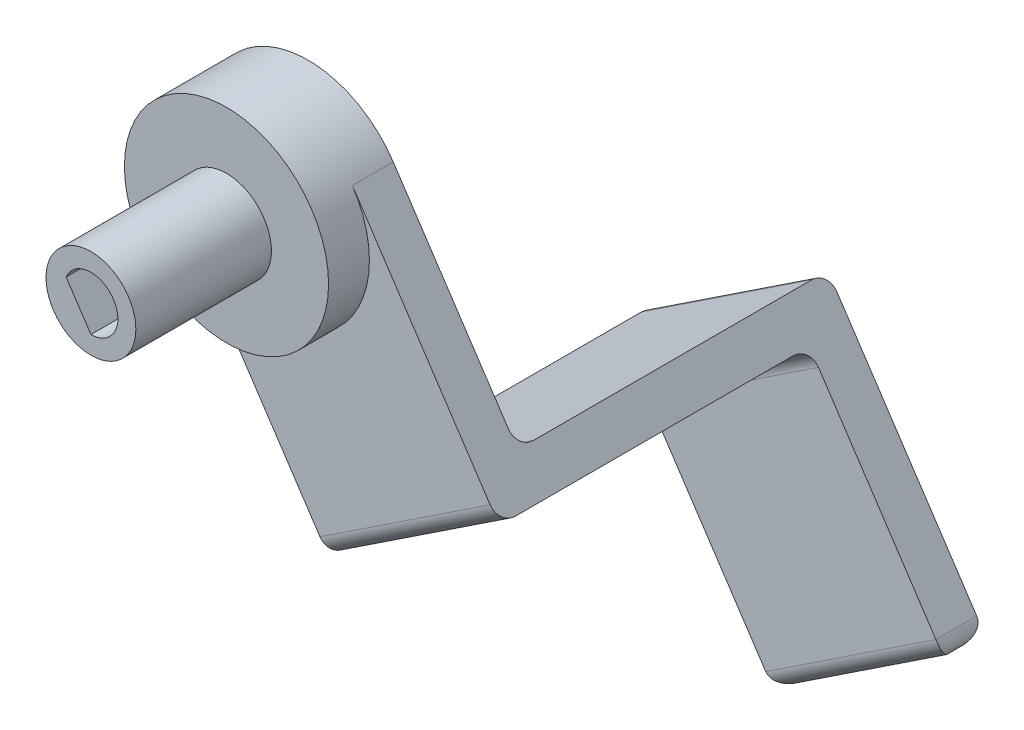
ISO-10303-21;
HEADER;
FILE_DESCRIPTION(('STEP AP214'),'2;1');
FILE_NAME('part.step','',(''),(''),'','','');
FILE_SCHEMA(('AUTOMOTIVE_DESIGN { 1 0 10303 214 1 1 1 1 }'));
ENDSEC;
DATA;
#1=APPLICATION_CONTEXT('core data for automotive mechanical design processes');
#2=APPLICATION_PROTOCOL_DEFINITION('international standard','automotive_design',2000,#1);
#3=PRODUCT_CONTEXT('',#1,'mechanical');
#4=PRODUCT('Part','Part','',(#3));
#5=PRODUCT_RELATED_PRODUCT_CATEGORY('part','',(#4));
#6=PRODUCT_DEFINITION_FORMATION('','',#4);
#7=PRODUCT_DEFINITION_CONTEXT('part definition',#1,'design');
#8=PRODUCT_DEFINITION('design','',#6,#7);
#9=PRODUCT_DEFINITION_SHAPE('','',#8);
#10=(LENGTH_UNIT() NAMED_UNIT(*) SI_UNIT(.MILLI.,.METRE.));
#11=(NAMED_UNIT(*) PLANE_ANGLE_UNIT() SI_UNIT($,.RADIAN.));
#12=(NAMED_UNIT(*) SI_UNIT($,.STERADIAN.) SOLID_ANGLE_UNIT());
#13=UNCERTAINTY_MEASURE_WITH_UNIT(LENGTH_MEASURE(1.E-05),#10,'distance_accuracy_value','');
#14=(GEOMETRIC_REPRESENTATION_CONTEXT(3) GLOBAL_UNCERTAINTY_ASSIGNED_CONTEXT((#13)) GLOBAL_UNIT_ASSIGNED_CONTEXT((#10,
#11,#12)) REPRESENTATION_CONTEXT('',''));
#15=CARTESIAN_POINT('',(0.,0.,0.));
#16=DIRECTION('',(0.,0.,1.));
#17=DIRECTION('',(1.,0.,0.));
#18=AXIS2_PLACEMENT_3D('',#15,#16,#17);
#19=CARTESIAN_POINT('',(16.4449312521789,-24.7916666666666,0.));
#20=DIRECTION('',(-0.552770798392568,0.833333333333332,0.));
#21=DIRECTION('',(-0.833333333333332,-0.552770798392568,0.));
#22=AXIS2_PLACEMENT_3D('',#19,#20,#21);
#23=PLANE('',#22);
#24=DIRECTION('',(0.,0.,1.));
#25=VECTOR('',#24,1.);
#26=CARTESIAN_POINT('',(28.3817176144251,-16.8736983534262,-20.));
#27=LINE('',#26,#25);
#28=CARTESIAN_POINT('',(28.3817176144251,-16.8736983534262,-51.));
#29=VERTEX_POINT('',#28);
#30=CARTESIAN_POINT('',(28.3817176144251,-16.8736983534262,-17.));
#31=VERTEX_POINT('',#30);
#32=EDGE_CURVE('E176',#29,#31,#27,.T.);
#33=ORIENTED_EDGE('',*,*,#32,.T.);
#34=DIRECTION('',(-0.833333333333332,-0.552770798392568,0.));
#35=VECTOR('',#34,1.);
#36=CARTESIAN_POINT('',(7.5483842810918,-30.6929683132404,-17.));
#37=LINE('',#36,#35);
#38=CARTESIAN_POINT('',(7.5483842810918,-30.6929683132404,-17.));
#39=VERTEX_POINT('',#38);
#40=EDGE_CURVE('E288',#31,#39,#37,.T.);
#41=ORIENTED_EDGE('',*,*,#40,.T.);
#42=DIRECTION('',(0.,0.,1.));
#43=VECTOR('',#42,1.);
#44=CARTESIAN_POINT('',(7.54838428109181,-30.6929683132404,-20.));
#45=LINE('',#44,#43);
#46=CARTESIAN_POINT('',(7.54838428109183,-30.6929683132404,-51.));
#47=VERTEX_POINT('',#46);
#48=EDGE_CURVE('E348',#47,#39,#45,.T.);
#49=ORIENTED_EDGE('',*,*,#48,.F.);
#50=DIRECTION('',(-0.833333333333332,-0.552770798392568,0.));
#51=VECTOR('',#50,1.);
#52=CARTESIAN_POINT('',(28.3817176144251,-16.8736983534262,-51.));
#53=LINE('',#52,#51);
#54=EDGE_CURVE('E285',#47,#29,#53,.F.);
#55=ORIENTED_EDGE('',*,*,#54,.T.);
#56=EDGE_LOOP('',(#33,#41,#49,#55));
#57=FACE_BOUND('',#56,.T.);
#58=ADVANCED_FACE('F47',(#57),#23,.F.);
#59=CARTESIAN_POINT('',(0.,3.3,6.6));
#60=DIRECTION('',(0.,0.,1.));
#61=DIRECTION('',(1.,0.,0.));
#62=AXIS2_PLACEMENT_3D('',#59,#60,#61);
#63=PLANE('',#62);
#64=CARTESIAN_POINT('',(0.,3.3,6.6));
#65=DIRECTION('',(0.,0.,1.));
#66=DIRECTION('',(1.,0.,0.));
#67=AXIS2_PLACEMENT_3D('',#64,#65,#66);
#68=CIRCLE('',#67,5.5);
#69=CARTESIAN_POINT('',(5.5,3.3,6.6));
#70=VERTEX_POINT('',#69);
#71=EDGE_CURVE('E224',#70,#70,#68,.T.);
#72=ORIENTED_EDGE('',*,*,#71,.T.);
#73=EDGE_LOOP('',(#72));
#74=FACE_BOUND('',#73,.T.);
#75=DIRECTION('',(0.552770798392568,-0.833333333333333,0.));
#76=VECTOR('',#75,1.);
#77=CARTESIAN_POINT('',(0.,0.,6.6));
#78=LINE('',#77,#76);
#79=CARTESIAN_POINT('',(-3.04023939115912,4.58333333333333,6.6));
#80=VERTEX_POINT('',#79);
#81=CARTESIAN_POINT('',(0.,0.,6.6));
#82=VERTEX_POINT('',#81);
#83=EDGE_CURVE('E207',#80,#82,#78,.T.);
#84=ORIENTED_EDGE('',*,*,#83,.F.);
#85=CARTESIAN_POINT('',(0.,3.3,6.6));
#86=DIRECTION('',(0.,0.,1.));
#87=DIRECTION('',(1.,0.,0.));
#88=AXIS2_PLACEMENT_3D('',#85,#86,#87);
#89=CIRCLE('',#88,3.3);
#90=EDGE_CURVE('E203',#82,#80,#89,.T.);
#91=ORIENTED_EDGE('',*,*,#90,.F.);
#92=EDGE_LOOP('',(#84,#91));
#93=FACE_BOUND('',#92,.T.);
#94=ADVANCED_FACE('F420',(#74,#93),#63,.T.);
#95=CARTESIAN_POINT('',(0.,3.3,6.6));
#96=DIRECTION('',(0.,0.,-1.));
#97=DIRECTION('',(-1.,0.,0.));
#98=AXIS2_PLACEMENT_3D('',#95,#96,#97);
#99=CYLINDRICAL_SURFACE('',#98,5.5);
#100=ORIENTED_EDGE('',*,*,#71,.F.);
#101=EDGE_LOOP('',(#100));
#102=FACE_BOUND('',#101,.T.);
#103=CARTESIAN_POINT('',(0.,3.3,-10.));
#104=DIRECTION('',(0.,0.,-1.));
#105=DIRECTION('',(-1.,0.,0.));
#106=AXIS2_PLACEMENT_3D('',#103,#104,#105);
#107=CIRCLE('',#106,5.5);
#108=CARTESIAN_POINT('',(-5.5,3.3,-10.));
#109=VERTEX_POINT('',#108);
#110=EDGE_CURVE('E191',#109,#109,#107,.T.);
#111=ORIENTED_EDGE('',*,*,#110,.F.);
#112=EDGE_LOOP('',(#111));
#113=FACE_BOUND('',#112,.T.);
#114=ADVANCED_FACE('F427',(#102,#113),#99,.T.);
#115=CARTESIAN_POINT('',(0.,3.3,6.6));
#116=DIRECTION('',(0.,0.,-1.));
#117=DIRECTION('',(-1.,0.,0.));
#118=AXIS2_PLACEMENT_3D('',#115,#116,#117);
#119=CYLINDRICAL_SURFACE('',#118,3.3);
#120=CARTESIAN_POINT('',(0.,3.3,0.));
#121=DIRECTION('',(0.,0.,1.));
#122=DIRECTION('',(1.,0.,0.));
#123=AXIS2_PLACEMENT_3D('',#120,#121,#122);
#124=CIRCLE('',#123,3.3);
#125=CARTESIAN_POINT('',(0.,0.,0.));
#126=VERTEX_POINT('',#125);
#127=CARTESIAN_POINT('',(-3.04023939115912,4.58333333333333,0.));
#128=VERTEX_POINT('',#127);
#129=EDGE_CURVE('E197',#126,#128,#124,.T.);
#130=ORIENTED_EDGE('',*,*,#129,.F.);
#131=DIRECTION('',(0.,0.,-1.));
#132=VECTOR('',#131,1.);
#133=CARTESIAN_POINT('',(0.,0.,6.6));
#134=LINE('',#133,#132);
#135=EDGE_CURVE('E211',#82,#126,#134,.T.);
#136=ORIENTED_EDGE('',*,*,#135,.F.);
#137=ORIENTED_EDGE('',*,*,#90,.T.);
#138=DIRECTION('',(0.,0.,-1.));
#139=VECTOR('',#138,1.);
#140=CARTESIAN_POINT('',(-3.04023939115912,4.58333333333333,6.6));
#141=LINE('',#140,#139);
#142=EDGE_CURVE('E220',#80,#128,#141,.T.);
#143=ORIENTED_EDGE('',*,*,#142,.T.);
#144=EDGE_LOOP('',(#130,#136,#137,#143));
#145=FACE_BOUND('',#144,.T.);
#146=ADVANCED_FACE('F452',(#145),#119,.F.);
#147=CARTESIAN_POINT('',(0.,0.,6.6));
#148=DIRECTION('',(0.833333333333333,0.552770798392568,0.));
#149=DIRECTION('',(-0.552770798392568,0.833333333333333,0.));
#150=AXIS2_PLACEMENT_3D('',#147,#148,#149);
#151=PLANE('',#150);
#152=DIRECTION('',(0.552770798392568,-0.833333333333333,0.));
#153=VECTOR('',#152,1.);
#154=CARTESIAN_POINT('',(0.,0.,0.));
#155=LINE('',#154,#153);
#156=EDGE_CURVE('E208',#128,#126,#155,.T.);
#157=ORIENTED_EDGE('',*,*,#156,.F.);
#158=ORIENTED_EDGE('',*,*,#142,.F.);
#159=ORIENTED_EDGE('',*,*,#83,.T.);
#160=ORIENTED_EDGE('',*,*,#135,.T.);
#161=EDGE_LOOP('',(#157,#158,#159,#160));
#162=FACE_BOUND('',#161,.T.);
#163=ADVANCED_FACE('F448',(#162),#151,.T.);
#164=CARTESIAN_POINT('',(0.,3.3,0.));
#165=DIRECTION('',(0.,0.,-1.));
#166=DIRECTION('',(-1.,0.,0.));
#167=AXIS2_PLACEMENT_3D('',#164,#165,#166);
#168=PLANE('',#167);
#169=ORIENTED_EDGE('',*,*,#156,.T.);
#170=ORIENTED_EDGE('',*,*,#129,.T.);
#171=EDGE_LOOP('',(#169,#170));
#172=FACE_BOUND('',#171,.T.);
#173=ADVANCED_FACE('F445',(#172),#168,.F.);
#174=CARTESIAN_POINT('',(0.,3.3,-20.));
#175=DIRECTION('',(0.,0.,1.));
#176=DIRECTION('',(1.,0.,0.));
#177=AXIS2_PLACEMENT_3D('',#174,#175,#176);
#178=CYLINDRICAL_SURFACE('',#177,12.5);
#179=CARTESIAN_POINT('',(0.,3.3,-20.));
#180=DIRECTION('',(0.,0.,-1.));
#181=DIRECTION('',(-1.,0.,0.));
#182=AXIS2_PLACEMENT_3D('',#179,#180,#181);
#183=CIRCLE('',#182,12.5);
#184=CARTESIAN_POINT('',(-10.4166666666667,-3.6096349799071,-20.));
#185=VERTEX_POINT('',#184);
#186=CARTESIAN_POINT('',(10.4166666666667,10.2096349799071,-20.));
#187=VERTEX_POINT('',#186);
#188=EDGE_CURVE('E181',#185,#187,#183,.T.);
#189=ORIENTED_EDGE('',*,*,#188,.F.);
#190=DIRECTION('',(0.,0.,1.));
#191=VECTOR('',#190,1.);
#192=CARTESIAN_POINT('',(-10.4166666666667,-3.6096349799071,-20.));
#193=LINE('',#192,#191);
#194=CARTESIAN_POINT('',(-10.4166666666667,-3.6096349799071,-15.));
#195=VERTEX_POINT('',#194);
#196=EDGE_CURVE('E163',#185,#195,#193,.T.);
#197=ORIENTED_EDGE('',*,*,#196,.T.);
#198=CARTESIAN_POINT('',(0.,3.3,-15.));
#199=DIRECTION('',(0.,0.,1.));
#200=DIRECTION('',(1.,0.,0.));
#201=AXIS2_PLACEMENT_3D('',#198,#199,#200);
#202=CIRCLE('',#201,12.5);
#203=CARTESIAN_POINT('',(10.4166666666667,10.2096349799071,-15.));
#204=VERTEX_POINT('',#203);
#205=EDGE_CURVE('E228',#195,#204,#202,.T.);
#206=ORIENTED_EDGE('',*,*,#205,.T.);
#207=DIRECTION('',(0.,0.,1.));
#208=VECTOR('',#207,1.);
#209=CARTESIAN_POINT('',(10.4166666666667,10.2096349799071,-20.));
#210=LINE('',#209,#208);
#211=EDGE_CURVE('E175',#187,#204,#210,.T.);
#212=ORIENTED_EDGE('',*,*,#211,.F.);
#213=EDGE_LOOP('',(#189,#197,#206,#212));
#214=FACE_BOUND('',#213,.T.);
#215=CARTESIAN_POINT('',(0.,3.3,-10.));
#216=DIRECTION('',(0.,0.,-1.));
#217=DIRECTION('',(-1.,0.,0.));
#218=AXIS2_PLACEMENT_3D('',#215,#216,#217);
#219=CIRCLE('',#218,12.5);
#220=CARTESIAN_POINT('',(-12.5,3.3,-10.));
#221=VERTEX_POINT('',#220);
#222=EDGE_CURVE('E184',#221,#221,#219,.T.);
#223=ORIENTED_EDGE('',*,*,#222,.T.);
#224=EDGE_LOOP('',(#223));
#225=FACE_BOUND('',#224,.T.);
#226=ADVANCED_FACE('F187',(#214,#225),#178,.T.);
#227=CARTESIAN_POINT('',(0.,3.3,-20.));
#228=DIRECTION('',(0.,0.,-1.));
#229=DIRECTION('',(-1.,0.,0.));
#230=AXIS2_PLACEMENT_3D('',#227,#228,#229);
#231=PLANE('',#230);
#232=DIRECTION('',(0.552770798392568,-0.833333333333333,0.));
#233=VECTOR('',#232,1.);
#234=CARTESIAN_POINT('',(10.4166666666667,10.2096349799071,-20.));
#235=LINE('',#234,#233);
#236=CARTESIAN_POINT('',(24.5123220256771,-11.0403650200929,-20.));
#237=VERTEX_POINT('',#236);
#238=EDGE_CURVE('E357',#187,#237,#235,.T.);
#239=ORIENTED_EDGE('',*,*,#238,.T.);
#240=DIRECTION('',(0.833333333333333,0.552770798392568,0.));
#241=VECTOR('',#240,1.);
#242=CARTESIAN_POINT('',(14.0956553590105,-17.95,-20.));
#243=LINE('',#242,#241);
#244=CARTESIAN_POINT('',(3.67898869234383,-24.8596349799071,-20.));
#245=VERTEX_POINT('',#244);
#246=EDGE_CURVE('E182',#237,#245,#243,.F.);
#247=ORIENTED_EDGE('',*,*,#246,.T.);
#248=DIRECTION('',(0.552770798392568,-0.833333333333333,0.));
#249=VECTOR('',#248,1.);
#250=CARTESIAN_POINT('',(-10.4166666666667,-3.6096349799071,-20.));
#251=LINE('',#250,#249);
#252=EDGE_CURVE('E167',#185,#245,#251,.T.);
#253=ORIENTED_EDGE('',*,*,#252,.F.);
#254=ORIENTED_EDGE('',*,*,#188,.T.);
#255=EDGE_LOOP('',(#239,#247,#253,#254));
#256=FACE_BOUND('',#255,.T.);
#257=ADVANCED_FACE('F180',(#256),#231,.T.);
#258=CARTESIAN_POINT('',(0.,3.3,-10.));
#259=DIRECTION('',(0.,0.,-1.));
#260=DIRECTION('',(-1.,0.,0.));
#261=AXIS2_PLACEMENT_3D('',#258,#259,#260);
#262=PLANE('',#261);
#263=ORIENTED_EDGE('',*,*,#110,.T.);
#264=EDGE_LOOP('',(#263));
#265=FACE_BOUND('',#264,.T.);
#266=ORIENTED_EDGE('',*,*,#222,.F.);
#267=EDGE_LOOP('',(#266));
#268=FACE_BOUND('',#267,.T.);
#269=ADVANCED_FACE('F439',(#265,#268),#262,.F.);
#270=CARTESIAN_POINT('',(-10.4166666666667,-3.6096349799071,-20.));
#271=DIRECTION('',(0.833333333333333,0.552770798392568,0.));
#272=DIRECTION('',(-0.552770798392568,0.833333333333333,0.));
#273=AXIS2_PLACEMENT_3D('',#270,#271,#272);
#274=PLANE('',#273);
#275=DIRECTION('',(-0.552770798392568,0.833333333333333,0.));
#276=VECTOR('',#275,1.);
#277=CARTESIAN_POINT('',(4.78453028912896,-26.5263016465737,-58.));
#278=LINE('',#277,#276);
#279=CARTESIAN_POINT('',(23.0259666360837,-54.0263016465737,-58.));
#280=VERTEX_POINT('',#279);
#281=CARTESIAN_POINT('',(5.8900718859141,-28.1929683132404,-58.));
#282=VERTEX_POINT('',#281);
#283=EDGE_CURVE('E331',#280,#282,#278,.T.);
#284=ORIENTED_EDGE('',*,*,#283,.F.);
#285=DIRECTION('',(0.,0.,-1.));
#286=VECTOR('',#285,1.);
#287=CARTESIAN_POINT('',(23.0259666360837,-54.0263016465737,-53.));
#288=LINE('',#287,#286);
#289=CARTESIAN_POINT('',(23.0259666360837,-54.0263016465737,-53.));
#290=VERTEX_POINT('',#289);
#291=EDGE_CURVE('E250',#280,#290,#288,.F.);
#292=ORIENTED_EDGE('',*,*,#291,.T.);
#293=DIRECTION('',(-0.552770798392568,0.833333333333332,0.));
#294=VECTOR('',#293,1.);
#295=CARTESIAN_POINT('',(24.1315082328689,-55.6929683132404,-53.));
#296=LINE('',#295,#294);
#297=CARTESIAN_POINT('',(8.65392587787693,-32.3596349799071,-53.));
#298=VERTEX_POINT('',#297);
#299=EDGE_CURVE('E317',#290,#298,#296,.T.);
#300=ORIENTED_EDGE('',*,*,#299,.T.);
#301=CARTESIAN_POINT('',(8.65392587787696,-32.359634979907,-51.));
#302=DIRECTION('',(0.833333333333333,0.552770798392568,0.));
#303=DIRECTION('',(-0.552770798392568,0.833333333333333,0.));
#304=AXIS2_PLACEMENT_3D('',#301,#302,#303);
#305=CIRCLE('',#304,2.);
#306=EDGE_CURVE('E57',#298,#47,#305,.T.);
#307=ORIENTED_EDGE('',*,*,#306,.T.);
#308=ORIENTED_EDGE('',*,*,#48,.T.);
#309=CARTESIAN_POINT('',(6.44284268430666,-29.0263016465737,-17.));
#310=DIRECTION('',(0.833333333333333,0.552770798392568,0.));
#311=DIRECTION('',(-0.552770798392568,0.833333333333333,0.));
#312=AXIS2_PLACEMENT_3D('',#309,#310,#311);
#313=CIRCLE('',#312,2.);
#314=CARTESIAN_POINT('',(6.44284268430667,-29.0263016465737,-15.));
#315=VERTEX_POINT('',#314);
#316=EDGE_CURVE('E247',#39,#315,#313,.F.);
#317=ORIENTED_EDGE('',*,*,#316,.T.);
#318=DIRECTION('',(0.552770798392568,-0.833333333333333,0.));
#319=VECTOR('',#318,1.);
#320=CARTESIAN_POINT('',(-10.4166666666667,-3.6096349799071,-15.));
#321=LINE('',#320,#319);
#322=EDGE_CURVE('E170',#195,#315,#321,.T.);
#323=ORIENTED_EDGE('',*,*,#322,.F.);
#324=ORIENTED_EDGE('',*,*,#196,.F.);
#325=ORIENTED_EDGE('',*,*,#252,.T.);
#326=CARTESIAN_POINT('',(3.67898869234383,-24.8596349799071,-22.));
#327=DIRECTION('',(0.833333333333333,0.552770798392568,0.));
#328=DIRECTION('',(-0.552770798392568,0.833333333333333,0.));
#329=AXIS2_PLACEMENT_3D('',#326,#327,#328);
#330=CIRCLE('',#329,2.);
#331=CARTESIAN_POINT('',(4.78453028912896,-26.5263016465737,-22.));
#332=VERTEX_POINT('',#331);
#333=EDGE_CURVE('E297',#245,#332,#330,.T.);
#334=ORIENTED_EDGE('',*,*,#333,.T.);
#335=DIRECTION('',(0.,0.,1.));
#336=VECTOR('',#335,1.);
#337=CARTESIAN_POINT('',(4.78453028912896,-26.5263016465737,-58.));
#338=LINE('',#337,#336);
#339=CARTESIAN_POINT('',(4.78453028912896,-26.5263016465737,-56.));
#340=VERTEX_POINT('',#339);
#341=EDGE_CURVE('E344',#340,#332,#338,.T.);
#342=ORIENTED_EDGE('',*,*,#341,.F.);
#343=CARTESIAN_POINT('',(5.89007188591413,-28.1929683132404,-56.));
#344=DIRECTION('',(0.833333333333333,0.552770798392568,0.));
#345=DIRECTION('',(-0.552770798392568,0.833333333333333,0.));
#346=AXIS2_PLACEMENT_3D('',#343,#344,#345);
#347=CIRCLE('',#346,2.);
#348=EDGE_CURVE('E244',#340,#282,#347,.F.);
#349=ORIENTED_EDGE('',*,*,#348,.T.);
#350=EDGE_LOOP('',(#284,#292,#300,#307,#308,#317,#323,#324,#325,#334,#342,#349));
#351=FACE_BOUND('',#350,.T.);
#352=ADVANCED_FACE('F166',(#351),#274,.F.);
#353=CARTESIAN_POINT('',(10.4166666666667,10.2096349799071,-15.));
#354=DIRECTION('',(0.,0.,1.));
#355=DIRECTION('',(1.,0.,0.));
#356=AXIS2_PLACEMENT_3D('',#353,#354,#355);
#357=PLANE('',#356);
#358=ORIENTED_EDGE('',*,*,#322,.T.);
#359=DIRECTION('',(-0.833333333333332,-0.552770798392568,0.));
#360=VECTOR('',#359,1.);
#361=CARTESIAN_POINT('',(27.27617601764,-15.2070316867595,-15.));
#362=LINE('',#361,#360);
#363=CARTESIAN_POINT('',(27.27617601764,-15.2070316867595,-15.));
#364=VERTEX_POINT('',#363);
#365=EDGE_CURVE('E292',#315,#364,#362,.F.);
#366=ORIENTED_EDGE('',*,*,#365,.T.);
#367=DIRECTION('',(0.552770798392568,-0.833333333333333,0.));
#368=VECTOR('',#367,1.);
#369=CARTESIAN_POINT('',(10.4166666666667,10.2096349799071,-15.));
#370=LINE('',#369,#368);
#371=EDGE_CURVE('E360',#204,#364,#370,.T.);
#372=ORIENTED_EDGE('',*,*,#371,.F.);
#373=ORIENTED_EDGE('',*,*,#205,.F.);
#374=EDGE_LOOP('',(#358,#366,#372,#373));
#375=FACE_BOUND('',#374,.T.);
#376=ADVANCED_FACE('F367',(#375),#357,.T.);
#377=CARTESIAN_POINT('',(10.4166666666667,10.2096349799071,-20.));
#378=DIRECTION('',(0.833333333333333,0.552770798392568,0.));
#379=DIRECTION('',(-0.552770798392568,0.833333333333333,0.));
#380=AXIS2_PLACEMENT_3D('',#377,#378,#379);
#381=PLANE('',#380);
#382=DIRECTION('',(-0.552770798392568,0.833333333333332,0.));
#383=VECTOR('',#382,1.);
#384=CARTESIAN_POINT('',(44.9648415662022,-41.8736983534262,-53.));
#385=LINE('',#384,#383);
#386=CARTESIAN_POINT('',(43.859299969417,-40.2070316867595,-53.));
#387=VERTEX_POINT('',#386);
#388=CARTESIAN_POINT('',(29.4872592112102,-18.5403650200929,-53.));
#389=VERTEX_POINT('',#388);
#390=EDGE_CURVE('E325',#387,#389,#385,.T.);
#391=ORIENTED_EDGE('',*,*,#390,.F.);
#392=DIRECTION('',(0.,0.,1.));
#393=VECTOR('',#392,1.);
#394=CARTESIAN_POINT('',(43.859299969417,-40.2070316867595,-20.));
#395=LINE('',#394,#393);
#396=CARTESIAN_POINT('',(43.859299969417,-40.2070316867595,-58.));
#397=VERTEX_POINT('',#396);
#398=EDGE_CURVE('E260',#387,#397,#395,.F.);
#399=ORIENTED_EDGE('',*,*,#398,.T.);
#400=DIRECTION('',(0.552770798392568,-0.833333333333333,0.));
#401=VECTOR('',#400,1.);
#402=CARTESIAN_POINT('',(28.3817176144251,-16.8736983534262,-58.));
#403=LINE('',#402,#401);
#404=CARTESIAN_POINT('',(26.7234052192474,-14.3736983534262,-58.));
#405=VERTEX_POINT('',#404);
#406=EDGE_CURVE('E337',#405,#397,#403,.T.);
#407=ORIENTED_EDGE('',*,*,#406,.F.);
#408=CARTESIAN_POINT('',(26.7234052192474,-14.3736983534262,-56.));
#409=DIRECTION('',(0.833333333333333,0.552770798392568,0.));
#410=DIRECTION('',(-0.552770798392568,0.833333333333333,0.));
#411=AXIS2_PLACEMENT_3D('',#408,#409,#410);
#412=CIRCLE('',#411,2.);
#413=CARTESIAN_POINT('',(25.6178636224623,-12.7070316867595,-56.));
#414=VERTEX_POINT('',#413);
#415=EDGE_CURVE('E254',#405,#414,#412,.T.);
#416=ORIENTED_EDGE('',*,*,#415,.T.);
#417=DIRECTION('',(0.,0.,1.));
#418=VECTOR('',#417,1.);
#419=CARTESIAN_POINT('',(25.6178636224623,-12.7070316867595,-58.));
#420=LINE('',#419,#418);
#421=CARTESIAN_POINT('',(25.6178636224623,-12.7070316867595,-22.));
#422=VERTEX_POINT('',#421);
#423=EDGE_CURVE('E341',#414,#422,#420,.T.);
#424=ORIENTED_EDGE('',*,*,#423,.T.);
#425=CARTESIAN_POINT('',(24.5123220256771,-11.0403650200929,-22.));
#426=DIRECTION('',(0.833333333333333,0.552770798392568,0.));
#427=DIRECTION('',(-0.552770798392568,0.833333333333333,0.));
#428=AXIS2_PLACEMENT_3D('',#425,#426,#427);
#429=CIRCLE('',#428,2.);
#430=EDGE_CURVE('E65',#422,#237,#429,.F.);
#431=ORIENTED_EDGE('',*,*,#430,.T.);
#432=ORIENTED_EDGE('',*,*,#238,.F.);
#433=ORIENTED_EDGE('',*,*,#211,.T.);
#434=ORIENTED_EDGE('',*,*,#371,.T.);
#435=CARTESIAN_POINT('',(27.27617601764,-15.2070316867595,-17.));
#436=DIRECTION('',(0.833333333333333,0.552770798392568,0.));
#437=DIRECTION('',(-0.552770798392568,0.833333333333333,0.));
#438=AXIS2_PLACEMENT_3D('',#435,#436,#437);
#439=CIRCLE('',#438,2.);
#440=EDGE_CURVE('E257',#364,#31,#439,.T.);
#441=ORIENTED_EDGE('',*,*,#440,.T.);
#442=ORIENTED_EDGE('',*,*,#32,.F.);
#443=CARTESIAN_POINT('',(29.4872592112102,-18.5403650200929,-51.));
#444=DIRECTION('',(0.833333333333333,0.552770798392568,0.));
#445=DIRECTION('',(-0.552770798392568,0.833333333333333,0.));
#446=AXIS2_PLACEMENT_3D('',#443,#444,#445);
#447=CIRCLE('',#446,2.);
#448=EDGE_CURVE('E11',#29,#389,#447,.F.);
#449=ORIENTED_EDGE('',*,*,#448,.T.);
#450=EDGE_LOOP('',(#391,#399,#407,#416,#424,#431,#432,#433,#434,#441,#442,#449));
#451=FACE_BOUND('',#450,.T.);
#452=ADVANCED_FACE('F374',(#451),#381,.T.);
#453=CARTESIAN_POINT('',(25.6178636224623,-12.7070316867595,-58.));
#454=DIRECTION('',(0.552770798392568,-0.833333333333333,0.));
#455=DIRECTION('',(0.833333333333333,0.552770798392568,0.));
#456=AXIS2_PLACEMENT_3D('',#453,#454,#455);
#457=PLANE('',#456);
#458=ORIENTED_EDGE('',*,*,#341,.T.);
#459=DIRECTION('',(0.833333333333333,0.552770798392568,0.));
#460=VECTOR('',#459,1.);
#461=CARTESIAN_POINT('',(25.6178636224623,-12.7070316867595,-22.));
#462=LINE('',#461,#460);
#463=EDGE_CURVE('E280',#332,#422,#462,.T.);
#464=ORIENTED_EDGE('',*,*,#463,.T.);
#465=ORIENTED_EDGE('',*,*,#423,.F.);
#466=DIRECTION('',(0.833333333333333,0.552770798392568,0.));
#467=VECTOR('',#466,1.);
#468=CARTESIAN_POINT('',(25.6178636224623,-12.7070316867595,-56.));
#469=LINE('',#468,#467);
#470=EDGE_CURVE('E277',#414,#340,#469,.F.);
#471=ORIENTED_EDGE('',*,*,#470,.T.);
#472=EDGE_LOOP('',(#458,#464,#465,#471));
#473=FACE_BOUND('',#472,.T.);
#474=ADVANCED_FACE('F407',(#473),#457,.F.);
#475=CARTESIAN_POINT('',(0.,0.,-58.));
#476=DIRECTION('',(0.,0.,1.));
#477=DIRECTION('',(1.,0.,0.));
#478=AXIS2_PLACEMENT_3D('',#475,#476,#477);
#479=PLANE('',#478);
#480=ORIENTED_EDGE('',*,*,#406,.T.);
#481=DIRECTION('',(0.833333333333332,0.552770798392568,0.));
#482=VECTOR('',#481,1.);
#483=CARTESIAN_POINT('',(23.0259666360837,-54.0263016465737,-58.));
#484=LINE('',#483,#482);
#485=EDGE_CURVE('E274',#397,#280,#484,.F.);
#486=ORIENTED_EDGE('',*,*,#485,.T.);
#487=ORIENTED_EDGE('',*,*,#283,.T.);
#488=DIRECTION('',(0.833333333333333,0.552770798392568,0.));
#489=VECTOR('',#488,1.);
#490=CARTESIAN_POINT('',(14.7866188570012,-22.2916666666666,-58.));
#491=LINE('',#490,#489);
#492=EDGE_CURVE('E270',#282,#405,#491,.T.);
#493=ORIENTED_EDGE('',*,*,#492,.T.);
#494=EDGE_LOOP('',(#480,#486,#487,#493));
#495=FACE_BOUND('',#494,.T.);
#496=ADVANCED_FACE('F399',(#495),#479,.F.);
#497=CARTESIAN_POINT('',(24.1315082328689,-55.6929683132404,-53.));
#498=DIRECTION('',(0.,0.,-1.));
#499=DIRECTION('',(-1.,0.,0.));
#500=AXIS2_PLACEMENT_3D('',#497,#498,#499);
#501=PLANE('',#500);
#502=ORIENTED_EDGE('',*,*,#299,.F.);
#503=DIRECTION('',(-0.833333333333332,-0.552770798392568,0.));
#504=VECTOR('',#503,1.);
#505=CARTESIAN_POINT('',(43.859299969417,-40.2070316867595,-53.));
#506=LINE('',#505,#504);
#507=EDGE_CURVE('E267',#290,#387,#506,.F.);
#508=ORIENTED_EDGE('',*,*,#507,.T.);
#509=ORIENTED_EDGE('',*,*,#390,.T.);
#510=DIRECTION('',(-0.833333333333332,-0.552770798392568,0.));
#511=VECTOR('',#510,1.);
#512=CARTESIAN_POINT('',(8.65392587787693,-32.3596349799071,-53.));
#513=LINE('',#512,#511);
#514=EDGE_CURVE('E263',#389,#298,#513,.T.);
#515=ORIENTED_EDGE('',*,*,#514,.T.);
#516=EDGE_LOOP('',(#502,#508,#509,#515));
#517=FACE_BOUND('',#516,.T.);
#518=ADVANCED_FACE('F383',(#517),#501,.F.);
#519=CARTESIAN_POINT('',(33.028055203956,-49.7916666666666,0.));
#520=DIRECTION('',(0.552770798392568,-0.833333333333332,0.));
#521=DIRECTION('',(0.833333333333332,0.552770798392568,0.));
#522=AXIS2_PLACEMENT_3D('',#519,#520,#521);
#523=PLANE('',#522);
#524=DIRECTION('',(0.,0.,1.));
#525=VECTOR('',#524,1.);
#526=CARTESIAN_POINT('',(43.2981748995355,-42.9792399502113,0.));
#527=LINE('',#526,#525);
#528=CARTESIAN_POINT('',(43.2981748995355,-42.9792399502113,-56.));
#529=VERTEX_POINT('',#528);
#530=CARTESIAN_POINT('',(43.2981748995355,-42.9792399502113,-55.));
#531=VERTEX_POINT('',#530);
#532=EDGE_CURVE('E234',#529,#531,#527,.T.);
#533=ORIENTED_EDGE('',*,*,#532,.T.);
#534=DIRECTION('',(-0.833333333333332,-0.552770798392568,0.));
#535=VECTOR('',#534,1.);
#536=CARTESIAN_POINT('',(24.1315082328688,-55.6929683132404,-55.));
#537=LINE('',#536,#535);
#538=CARTESIAN_POINT('',(25.7981748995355,-54.5874267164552,-55.));
#539=VERTEX_POINT('',#538);
#540=EDGE_CURVE('E241',#531,#539,#537,.T.);
#541=ORIENTED_EDGE('',*,*,#540,.T.);
#542=DIRECTION('',(0.,0.,-1.));
#543=VECTOR('',#542,1.);
#544=CARTESIAN_POINT('',(25.7981748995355,-54.5874267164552,-58.));
#545=LINE('',#544,#543);
#546=CARTESIAN_POINT('',(25.7981748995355,-54.5874267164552,-56.));
#547=VERTEX_POINT('',#546);
#548=EDGE_CURVE('E237',#539,#547,#545,.T.);
#549=ORIENTED_EDGE('',*,*,#548,.T.);
#550=DIRECTION('',(0.833333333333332,0.552770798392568,0.));
#551=VECTOR('',#550,1.);
#552=CARTESIAN_POINT('',(44.9648415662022,-41.8736983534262,-56.));
#553=LINE('',#552,#551);
#554=EDGE_CURVE('E231',#547,#529,#553,.T.);
#555=ORIENTED_EDGE('',*,*,#554,.T.);
#556=EDGE_LOOP('',(#533,#541,#549,#555));
#557=FACE_BOUND('',#556,.T.);
#558=ADVANCED_FACE('F394',(#557),#523,.T.);
#559=CARTESIAN_POINT('',(42.1926333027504,-41.3125732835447,0.));
#560=DIRECTION('',(0.,0.,1.));
#561=DIRECTION('',(1.,0.,0.));
#562=AXIS2_PLACEMENT_3D('',#559,#560,#561);
#563=CYLINDRICAL_SURFACE('',#562,2.);
#564=CARTESIAN_POINT('',(42.1926333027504,-41.3125732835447,-56.));
#565=DIRECTION('',(-0.589255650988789,-0.390867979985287,-0.707106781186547));
#566=DIRECTION('',(-0.589255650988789,-0.390867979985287,0.707106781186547));
#567=AXIS2_PLACEMENT_3D('',#564,#565,#566);
#568=ELLIPSE('',#567,2.82842712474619,2.);
#569=EDGE_CURVE('E307',#397,#529,#568,.T.);
#570=ORIENTED_EDGE('',*,*,#569,.F.);
#571=ORIENTED_EDGE('',*,*,#398,.F.);
#572=CARTESIAN_POINT('',(42.1926333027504,-41.3125732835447,-55.));
#573=DIRECTION('',(0.589255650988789,0.390867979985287,-0.707106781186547));
#574=DIRECTION('',(0.589255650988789,0.390867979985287,0.707106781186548));
#575=AXIS2_PLACEMENT_3D('',#572,#573,#574);
#576=ELLIPSE('',#575,2.82842712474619,2.);
#577=EDGE_CURVE('E51',#531,#387,#576,.F.);
#578=ORIENTED_EDGE('',*,*,#577,.F.);
#579=ORIENTED_EDGE('',*,*,#532,.F.);
#580=EDGE_LOOP('',(#570,#571,#578,#579));
#581=FACE_BOUND('',#580,.T.);
#582=ADVANCED_FACE('F396',(#581),#563,.T.);
#583=CARTESIAN_POINT('',(31.9225136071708,-48.125,-55.));
#584=DIRECTION('',(0.833333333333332,0.552770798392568,0.));
#585=DIRECTION('',(-0.552770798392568,0.833333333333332,0.));
#586=AXIS2_PLACEMENT_3D('',#583,#584,#585);
#587=CYLINDRICAL_SURFACE('',#586,2.);
#588=ORIENTED_EDGE('',*,*,#577,.T.);
#589=ORIENTED_EDGE('',*,*,#507,.F.);
#590=CARTESIAN_POINT('',(24.6926333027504,-52.9207600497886,-55.));
#591=DIRECTION('',(0.589255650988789,0.390867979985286,0.707106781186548));
#592=DIRECTION('',(0.589255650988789,0.390867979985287,-0.707106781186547));
#593=AXIS2_PLACEMENT_3D('',#590,#591,#592);
#594=ELLIPSE('',#593,2.82842712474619,2.);
#595=EDGE_CURVE('E305',#539,#290,#594,.F.);
#596=ORIENTED_EDGE('',*,*,#595,.F.);
#597=ORIENTED_EDGE('',*,*,#540,.F.);
#598=EDGE_LOOP('',(#588,#589,#596,#597));
#599=FACE_BOUND('',#598,.T.);
#600=ADVANCED_FACE('F385',(#599),#587,.T.);
#601=CARTESIAN_POINT('',(31.9225136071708,-48.125,-56.));
#602=DIRECTION('',(-0.833333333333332,-0.552770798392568,0.));
#603=DIRECTION('',(0.552770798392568,-0.833333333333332,0.));
#604=AXIS2_PLACEMENT_3D('',#601,#602,#603);
#605=CYLINDRICAL_SURFACE('',#604,2.);
#606=ORIENTED_EDGE('',*,*,#569,.T.);
#607=ORIENTED_EDGE('',*,*,#554,.F.);
#608=CARTESIAN_POINT('',(24.6926333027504,-52.9207600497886,-56.));
#609=DIRECTION('',(-0.589255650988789,-0.390867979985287,0.707106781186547));
#610=DIRECTION('',(-0.589255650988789,-0.390867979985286,-0.707106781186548));
#611=AXIS2_PLACEMENT_3D('',#608,#609,#610);
#612=ELLIPSE('',#611,2.82842712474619,2.);
#613=EDGE_CURVE('E302',#280,#547,#612,.T.);
#614=ORIENTED_EDGE('',*,*,#613,.F.);
#615=ORIENTED_EDGE('',*,*,#485,.F.);
#616=EDGE_LOOP('',(#606,#607,#614,#615));
#617=FACE_BOUND('',#616,.T.);
#618=ADVANCED_FACE('F391',(#617),#605,.T.);
#619=CARTESIAN_POINT('',(24.6926333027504,-52.9207600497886,0.));
#620=DIRECTION('',(0.,0.,1.));
#621=DIRECTION('',(1.,0.,0.));
#622=AXIS2_PLACEMENT_3D('',#619,#620,#621);
#623=CYLINDRICAL_SURFACE('',#622,2.);
#624=ORIENTED_EDGE('',*,*,#595,.T.);
#625=ORIENTED_EDGE('',*,*,#291,.F.);
#626=ORIENTED_EDGE('',*,*,#613,.T.);
#627=ORIENTED_EDGE('',*,*,#548,.F.);
#628=EDGE_LOOP('',(#624,#625,#626,#627));
#629=FACE_BOUND('',#628,.T.);
#630=ADVANCED_FACE('F390',(#629),#623,.T.);
#631=CARTESIAN_POINT('',(24.5123220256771,-11.0403650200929,-22.));
#632=DIRECTION('',(0.833333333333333,0.552770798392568,0.));
#633=DIRECTION('',(-0.552770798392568,0.833333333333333,0.));
#634=AXIS2_PLACEMENT_3D('',#631,#632,#633);
#635=CYLINDRICAL_SURFACE('',#634,2.);
#636=ORIENTED_EDGE('',*,*,#333,.F.);
#637=ORIENTED_EDGE('',*,*,#246,.F.);
#638=ORIENTED_EDGE('',*,*,#430,.F.);
#639=ORIENTED_EDGE('',*,*,#463,.F.);
#640=EDGE_LOOP('',(#636,#637,#638,#639));
#641=FACE_BOUND('',#640,.T.);
#642=ADVANCED_FACE('F409',(#641),#635,.F.);
#643=CARTESIAN_POINT('',(15.3393896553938,-23.125,-17.));
#644=DIRECTION('',(0.833333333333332,0.552770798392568,0.));
#645=DIRECTION('',(-0.552770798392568,0.833333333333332,0.));
#646=AXIS2_PLACEMENT_3D('',#643,#644,#645);
#647=CYLINDRICAL_SURFACE('',#646,2.);
#648=ORIENTED_EDGE('',*,*,#440,.F.);
#649=ORIENTED_EDGE('',*,*,#365,.F.);
#650=ORIENTED_EDGE('',*,*,#316,.F.);
#651=ORIENTED_EDGE('',*,*,#40,.F.);
#652=EDGE_LOOP('',(#648,#649,#650,#651));
#653=FACE_BOUND('',#652,.T.);
#654=ADVANCED_FACE('F370',(#653),#647,.T.);
#655=CARTESIAN_POINT('',(14.7866188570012,-22.2916666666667,-56.));
#656=DIRECTION('',(0.833333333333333,0.552770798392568,0.));
#657=DIRECTION('',(-0.552770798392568,0.833333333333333,0.));
#658=AXIS2_PLACEMENT_3D('',#655,#656,#657);
#659=CYLINDRICAL_SURFACE('',#658,2.);
#660=ORIENTED_EDGE('',*,*,#348,.F.);
#661=ORIENTED_EDGE('',*,*,#470,.F.);
#662=ORIENTED_EDGE('',*,*,#415,.F.);
#663=ORIENTED_EDGE('',*,*,#492,.F.);
#664=EDGE_LOOP('',(#660,#661,#662,#663));
#665=FACE_BOUND('',#664,.T.);
#666=ADVANCED_FACE('F403',(#665),#659,.T.);
#667=CARTESIAN_POINT('',(8.65392587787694,-32.3596349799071,-51.));
#668=DIRECTION('',(0.833333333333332,0.552770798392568,0.));
#669=DIRECTION('',(-0.552770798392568,0.833333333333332,0.));
#670=AXIS2_PLACEMENT_3D('',#667,#668,#669);
#671=CYLINDRICAL_SURFACE('',#670,2.);
#672=ORIENTED_EDGE('',*,*,#448,.F.);
#673=ORIENTED_EDGE('',*,*,#54,.F.);
#674=ORIENTED_EDGE('',*,*,#306,.F.);
#675=ORIENTED_EDGE('',*,*,#514,.F.);
#676=EDGE_LOOP('',(#672,#673,#674,#675));
#677=FACE_BOUND('',#676,.T.);
#678=ADVANCED_FACE('F49',(#677),#671,.F.);
#679=CLOSED_SHELL('',(#58,#94,#114,#146,#163,#173,#226,#257,#269,#352,#376,#452,#474,#496,#518,
#558,#582,#600,#618,#630,#642,#654,#666,#678));
#680=MANIFOLD_SOLID_BREP('B2',#679);
#681=ADVANCED_BREP_SHAPE_REPRESENTATION('',(#18,#680),#14);
#682=SHAPE_DEFINITION_REPRESENTATION(#9,#681);
ENDSEC;
END-ISO-10303-21;
